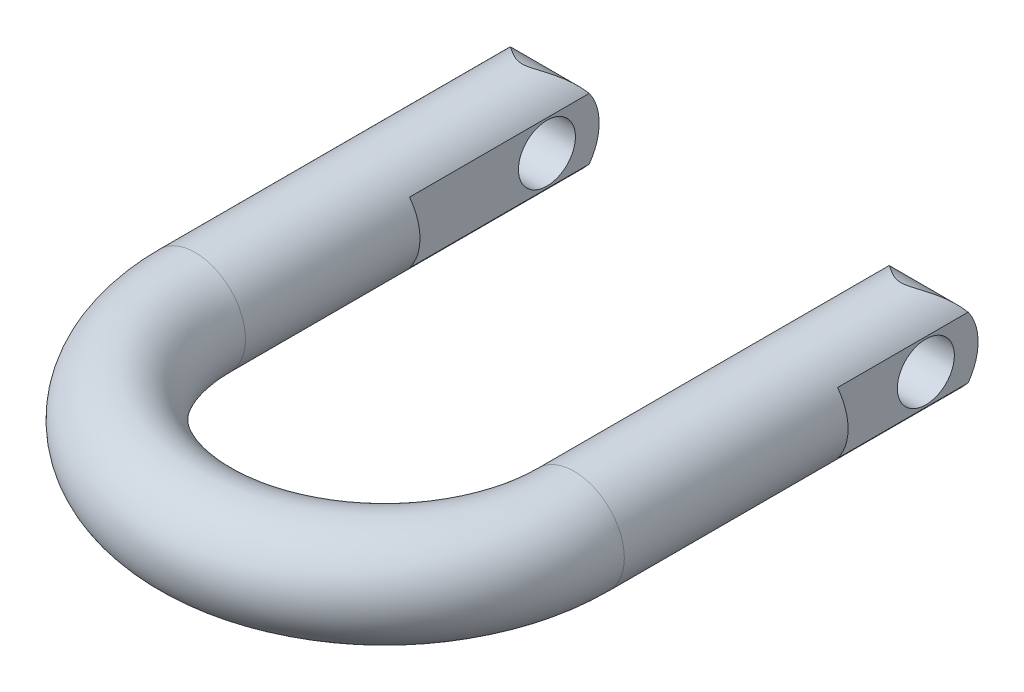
ISO-10303-21;
HEADER;
FILE_DESCRIPTION(('STEP AP214'),'2;1');
FILE_NAME('part.step','',(''),(''),'','','');
FILE_SCHEMA(('AUTOMOTIVE_DESIGN { 1 0 10303 214 1 1 1 1 }'));
ENDSEC;
DATA;
#1=APPLICATION_CONTEXT('core data for automotive mechanical design processes');
#2=APPLICATION_PROTOCOL_DEFINITION('international standard','automotive_design',2000,#1);
#3=PRODUCT_CONTEXT('',#1,'mechanical');
#4=PRODUCT('Part','Part','',(#3));
#5=PRODUCT_RELATED_PRODUCT_CATEGORY('part','',(#4));
#6=PRODUCT_DEFINITION_FORMATION('','',#4);
#7=PRODUCT_DEFINITION_CONTEXT('part definition',#1,'design');
#8=PRODUCT_DEFINITION('design','',#6,#7);
#9=PRODUCT_DEFINITION_SHAPE('','',#8);
#10=(LENGTH_UNIT() NAMED_UNIT(*) SI_UNIT(.MILLI.,.METRE.));
#11=(NAMED_UNIT(*) PLANE_ANGLE_UNIT() SI_UNIT($,.RADIAN.));
#12=(NAMED_UNIT(*) SI_UNIT($,.STERADIAN.) SOLID_ANGLE_UNIT());
#13=UNCERTAINTY_MEASURE_WITH_UNIT(LENGTH_MEASURE(1.E-05),#10,'distance_accuracy_value','');
#14=(GEOMETRIC_REPRESENTATION_CONTEXT(3) GLOBAL_UNCERTAINTY_ASSIGNED_CONTEXT((#13)) GLOBAL_UNIT_ASSIGNED_CONTEXT((#10,
#11,#12)) REPRESENTATION_CONTEXT('',''));
#15=CARTESIAN_POINT('',(0.,0.,0.));
#16=DIRECTION('',(0.,0.,1.));
#17=DIRECTION('',(1.,0.,0.));
#18=AXIS2_PLACEMENT_3D('',#15,#16,#17);
#19=CARTESIAN_POINT('',(-59.2,-30.,22.8));
#20=DIRECTION('',(1.,0.,0.));
#21=DIRECTION('',(0.,1.,0.));
#22=AXIS2_PLACEMENT_3D('',#19,#20,#21);
#23=PLANE('',#22);
#24=DIRECTION('',(0.,0.,-1.));
#25=VECTOR('',#24,1.);
#26=CARTESIAN_POINT('',(-59.2,7.91454357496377,80.6));
#27=LINE('',#26,#25);
#28=CARTESIAN_POINT('',(-59.2,7.91454357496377,-10.9366356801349));
#29=VERTEX_POINT('',#28);
#30=CARTESIAN_POINT('',(-59.2,7.91454357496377,22.8));
#31=VERTEX_POINT('',#30);
#32=EDGE_CURVE('E96',#29,#31,#27,.F.);
#33=ORIENTED_EDGE('',*,*,#32,.F.);
#34=CARTESIAN_POINT('',(-59.2,0.,0.));
#35=DIRECTION('',(1.,0.,0.));
#36=DIRECTION('',(0.,1.,0.));
#37=AXIS2_PLACEMENT_3D('',#34,#35,#36);
#38=CIRCLE('',#37,13.5);
#39=CARTESIAN_POINT('',(-59.2,-7.91454357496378,-10.9366356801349));
#40=VERTEX_POINT('',#39);
#41=EDGE_CURVE('E100',#40,#29,#38,.T.);
#42=ORIENTED_EDGE('',*,*,#41,.F.);
#43=DIRECTION('',(0.,0.,-1.));
#44=VECTOR('',#43,1.);
#45=CARTESIAN_POINT('',(-59.2,-7.91454357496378,80.6));
#46=LINE('',#45,#44);
#47=CARTESIAN_POINT('',(-59.2,-7.91454357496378,22.8));
#48=VERTEX_POINT('',#47);
#49=EDGE_CURVE('E85',#48,#40,#46,.T.);
#50=ORIENTED_EDGE('',*,*,#49,.F.);
#51=DIRECTION('',(0.,1.,0.));
#52=VECTOR('',#51,1.);
#53=CARTESIAN_POINT('',(-59.2,-30.,22.8));
#54=LINE('',#53,#52);
#55=EDGE_CURVE('E122',#48,#31,#54,.T.);
#56=ORIENTED_EDGE('',*,*,#55,.T.);
#57=EDGE_LOOP('',(#33,#42,#50,#56));
#58=FACE_BOUND('',#57,.T.);
#59=CARTESIAN_POINT('',(-59.2,0.,0.));
#60=DIRECTION('',(1.,0.,0.));
#61=DIRECTION('',(0.,0.,-1.));
#62=AXIS2_PLACEMENT_3D('',#59,#60,#61);
#63=CIRCLE('',#62,7.365);
#64=CARTESIAN_POINT('',(-59.2,0.,-7.36499999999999));
#65=VERTEX_POINT('',#64);
#66=EDGE_CURVE('E104',#65,#65,#63,.T.);
#67=ORIENTED_EDGE('',*,*,#66,.T.);
#68=EDGE_LOOP('',(#67));
#69=FACE_BOUND('',#68,.T.);
#70=ADVANCED_FACE('F14',(#58,#69),#23,.F.);
#71=CARTESIAN_POINT('',(-38.7,20.,35.5));
#72=DIRECTION('',(1.,0.,0.));
#73=DIRECTION('',(0.,1.,0.));
#74=AXIS2_PLACEMENT_3D('',#71,#72,#73);
#75=PLANE('',#74);
#76=CARTESIAN_POINT('',(-38.7,0.,0.));
#77=DIRECTION('',(1.,0.,0.));
#78=DIRECTION('',(0.,1.,0.));
#79=AXIS2_PLACEMENT_3D('',#76,#77,#78);
#80=CIRCLE('',#79,13.5);
#81=CARTESIAN_POINT('',(-38.7,7.91454357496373,-10.9366356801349));
#82=VERTEX_POINT('',#81);
#83=CARTESIAN_POINT('',(-38.7,-7.91454357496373,-10.9366356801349));
#84=VERTEX_POINT('',#83);
#85=EDGE_CURVE('E35',#82,#84,#80,.F.);
#86=ORIENTED_EDGE('',*,*,#85,.F.);
#87=DIRECTION('',(0.,0.,-1.));
#88=VECTOR('',#87,1.);
#89=CARTESIAN_POINT('',(-38.7,7.91454357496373,80.6));
#90=LINE('',#89,#88);
#91=CARTESIAN_POINT('',(-38.7,7.91454357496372,35.5));
#92=VERTEX_POINT('',#91);
#93=EDGE_CURVE('E118',#82,#92,#90,.F.);
#94=ORIENTED_EDGE('',*,*,#93,.T.);
#95=DIRECTION('',(0.,1.,0.));
#96=VECTOR('',#95,1.);
#97=CARTESIAN_POINT('',(-38.7,-20.,35.5));
#98=LINE('',#97,#96);
#99=CARTESIAN_POINT('',(-38.7,-7.91454357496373,35.5));
#100=VERTEX_POINT('',#99);
#101=EDGE_CURVE('E115',#100,#92,#98,.T.);
#102=ORIENTED_EDGE('',*,*,#101,.F.);
#103=DIRECTION('',(0.,0.,-1.));
#104=VECTOR('',#103,1.);
#105=CARTESIAN_POINT('',(-38.7,-7.91454357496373,80.6));
#106=LINE('',#105,#104);
#107=EDGE_CURVE('E120',#100,#84,#106,.T.);
#108=ORIENTED_EDGE('',*,*,#107,.T.);
#109=EDGE_LOOP('',(#86,#94,#102,#108));
#110=FACE_BOUND('',#109,.T.);
#111=CARTESIAN_POINT('',(-38.7,0.,0.));
#112=DIRECTION('',(1.,0.,0.));
#113=DIRECTION('',(0.,1.,0.));
#114=AXIS2_PLACEMENT_3D('',#111,#112,#113);
#115=CIRCLE('',#114,7.365);
#116=CARTESIAN_POINT('',(-38.7,7.36499999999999,0.));
#117=VERTEX_POINT('',#116);
#118=EDGE_CURVE('E106',#117,#117,#115,.T.);
#119=ORIENTED_EDGE('',*,*,#118,.F.);
#120=EDGE_LOOP('',(#119));
#121=FACE_BOUND('',#120,.T.);
#122=ADVANCED_FACE('F164',(#110,#121),#75,.T.);
#123=CARTESIAN_POINT('',(-48.95,0.,80.6));
#124=DIRECTION('',(0.,0.,-1.));
#125=DIRECTION('',(1.,0.,0.));
#126=AXIS2_PLACEMENT_3D('',#123,#124,#125);
#127=CYLINDRICAL_SURFACE('',#126,12.95);
#128=CARTESIAN_POINT('',(-48.95,0.,80.6));
#129=DIRECTION('',(0.,0.,1.));
#130=DIRECTION('',(0.,-1.,0.));
#131=AXIS2_PLACEMENT_3D('',#128,#129,#130);
#132=CIRCLE('',#131,12.95);
#133=CARTESIAN_POINT('',(-61.9,0.,80.6));
#134=VERTEX_POINT('',#133);
#135=EDGE_CURVE('E298',#134,#134,#132,.T.);
#136=ORIENTED_EDGE('',*,*,#135,.F.);
#137=EDGE_LOOP('',(#136));
#138=FACE_BOUND('',#137,.T.);
#139=CARTESIAN_POINT('',(-36.,0.,-13.5));
#140=CARTESIAN_POINT('',(-36.0000025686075,0.293199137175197,-13.4999974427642));
#141=CARTESIAN_POINT('',(-36.0099780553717,0.586445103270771,-13.4904275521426));
#142=CARTESIAN_POINT('',(-36.0496814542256,1.17048500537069,-13.4523487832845));
#143=CARTESIAN_POINT('',(-36.0794202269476,1.46127750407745,-13.4238294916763));
#144=CARTESIAN_POINT('',(-36.1581150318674,2.03842301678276,-13.3483967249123));
#145=CARTESIAN_POINT('',(-36.2071094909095,2.32476595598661,-13.3014464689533));
#146=CARTESIAN_POINT('',(-36.3233406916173,2.89020691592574,-13.1901381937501));
#147=CARTESIAN_POINT('',(-36.3905753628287,3.16930575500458,-13.1257821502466));
#148=CARTESIAN_POINT('',(-36.5415446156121,3.71654723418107,-12.9814013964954));
#149=CARTESIAN_POINT('',(-36.6251581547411,3.98475379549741,-12.9014916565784));
#150=CARTESIAN_POINT('',(-36.8078440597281,4.5108932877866,-12.7270857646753));
#151=CARTESIAN_POINT('',(-36.9069165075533,4.76882616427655,-12.6325895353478));
#152=CARTESIAN_POINT('',(-37.2252031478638,5.52546055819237,-12.3294033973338));
#153=CARTESIAN_POINT('',(-37.4656171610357,6.00745842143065,-12.1008908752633));
#154=CARTESIAN_POINT('',(-38.1000775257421,7.10877519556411,-11.5001649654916));
#155=CARTESIAN_POINT('',(-38.516769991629,7.70379205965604,-11.1073764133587));
#156=CARTESIAN_POINT('',(-39.1922448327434,8.5214166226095,-10.4763971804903));
#157=CARTESIAN_POINT('',(-39.4262930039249,8.78189008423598,-10.2586593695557));
#158=CARTESIAN_POINT('',(-39.9092753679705,9.27833910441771,-9.81191913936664));
#159=CARTESIAN_POINT('',(-40.1582085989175,9.51431624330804,-9.58291744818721));
#160=CARTESIAN_POINT('',(-40.7538609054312,10.0364632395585,-9.03907336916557));
#161=CARTESIAN_POINT('',(-41.105661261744,10.3133732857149,-8.72091959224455));
#162=CARTESIAN_POINT('',(-41.8303256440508,10.8263597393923,-8.07526114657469));
#163=CARTESIAN_POINT('',(-42.2032039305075,11.0624080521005,-7.74775022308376));
#164=CARTESIAN_POINT('',(-42.7775234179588,11.3864466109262,-7.25516783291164));
#165=CARTESIAN_POINT('',(-42.9713325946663,11.4893965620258,-7.09086172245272));
#166=CARTESIAN_POINT('',(-43.3643066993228,11.6854941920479,-6.7628178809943));
#167=CARTESIAN_POINT('',(-43.5634710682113,11.7786428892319,-6.59908009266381));
#168=CARTESIAN_POINT('',(-43.9674407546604,11.9551307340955,-6.2736814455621));
#169=CARTESIAN_POINT('',(-44.1722411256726,12.0384781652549,-6.11201893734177));
#170=CARTESIAN_POINT('',(-44.5884037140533,12.1954275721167,-5.79251015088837));
#171=CARTESIAN_POINT('',(-44.7997643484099,12.2690318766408,-5.63466296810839));
#172=CARTESIAN_POINT('',(-45.1612774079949,12.3843293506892,-5.37509175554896));
#173=CARTESIAN_POINT('',(-45.3093165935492,12.4286853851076,-5.27160616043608));
#174=CARTESIAN_POINT('',(-45.6095950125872,12.5127340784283,-5.06887715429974));
#175=CARTESIAN_POINT('',(-45.7618344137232,12.5524265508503,-4.96963391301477));
#176=CARTESIAN_POINT('',(-46.071116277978,12.6269481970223,-4.77711361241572));
#177=CARTESIAN_POINT('',(-46.2281559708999,12.6617801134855,-4.68383320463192));
#178=CARTESIAN_POINT('',(-46.5478629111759,12.7263040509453,-4.50557279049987));
#179=CARTESIAN_POINT('',(-46.710528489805,12.7559975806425,-4.420590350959));
#180=CARTESIAN_POINT('',(-47.1060547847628,12.820161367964,-4.23163825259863));
#181=CARTESIAN_POINT('',(-47.3419187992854,12.8520987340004,-4.13287958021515));
#182=CARTESIAN_POINT('',(-47.826418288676,12.9034447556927,-3.96971126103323));
#183=CARTESIAN_POINT('',(-48.0750109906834,12.922892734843,-3.9051939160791));
#184=CARTESIAN_POINT('',(-48.5400710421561,12.9452478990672,-3.83039349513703));
#185=CARTESIAN_POINT('',(-48.7552395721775,12.9503198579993,-3.81303212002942));
#186=CARTESIAN_POINT('',(-49.1852126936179,12.9496485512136,-3.81531215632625));
#187=CARTESIAN_POINT('',(-49.400017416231,12.943910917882,-3.83493429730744));
#188=CARTESIAN_POINT('',(-49.8846621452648,12.9191220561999,-3.91771502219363));
#189=CARTESIAN_POINT('',(-50.1523973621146,12.8966924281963,-3.99184892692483));
#190=CARTESIAN_POINT('',(-50.5424414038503,12.8523939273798,-4.13138570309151));
#191=CARTESIAN_POINT('',(-50.6708828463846,12.8357887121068,-4.18281008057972));
#192=CARTESIAN_POINT('',(-50.9240373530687,12.7992959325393,-4.2931816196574));
#193=CARTESIAN_POINT('',(-51.0487507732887,12.7794086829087,-4.35212805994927));
#194=CARTESIAN_POINT('',(-51.3381987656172,12.7290068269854,-4.49780208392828));
#195=CARTESIAN_POINT('',(-51.5014666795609,12.6972227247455,-4.58697565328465));
#196=CARTESIAN_POINT('',(-51.8224827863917,12.6284711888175,-4.77300446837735));
#197=CARTESIAN_POINT('',(-51.9802283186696,12.5915012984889,-4.86986334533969));
#198=CARTESIAN_POINT('',(-52.2911937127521,12.5125816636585,-5.06920193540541));
#199=CARTESIAN_POINT('',(-52.4444059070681,12.4706240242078,-5.17169041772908));
#200=CARTESIAN_POINT('',(-52.7467295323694,12.3819280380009,-5.38059161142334));
#201=CARTESIAN_POINT('',(-52.8958402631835,12.3351888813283,-5.48700498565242));
#202=CARTESIAN_POINT('',(-53.3391653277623,12.1875023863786,-5.81130116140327));
#203=CARTESIAN_POINT('',(-53.6280022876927,12.0794381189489,-6.03333236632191));
#204=CARTESIAN_POINT('',(-54.1938035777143,11.8447707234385,-6.48194753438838));
#205=CARTESIAN_POINT('',(-54.4707777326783,11.7181833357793,-6.70852749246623));
#206=CARTESIAN_POINT('',(-55.1267255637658,11.3901318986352,-7.25634261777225));
#207=CARTESIAN_POINT('',(-55.50065853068,11.1793177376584,-7.57807881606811));
#208=CARTESIAN_POINT('',(-56.2293451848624,10.7191067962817,-8.21619240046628));
#209=CARTESIAN_POINT('',(-56.5840872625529,10.4696870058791,-8.53256646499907));
#210=CARTESIAN_POINT('',(-57.2715078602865,9.93200378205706,-9.15276686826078));
#211=CARTESIAN_POINT('',(-57.6042643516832,9.64388998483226,-9.45663592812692));
#212=CARTESIAN_POINT('',(-58.2460445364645,9.02684677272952,-10.0473018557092));
#213=CARTESIAN_POINT('',(-58.5550839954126,8.69794485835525,-10.3341100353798));
#214=CARTESIAN_POINT('',(-59.0423131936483,8.12013881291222,-10.7887696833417));
#215=CARTESIAN_POINT('',(-59.2286040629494,7.88324209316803,-10.9632761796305));
#216=CARTESIAN_POINT('',(-59.5876514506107,7.39158213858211,-11.3005901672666));
#217=CARTESIAN_POINT('',(-59.7604119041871,7.13682413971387,-11.4634010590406));
#218=CARTESIAN_POINT('',(-60.0905062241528,6.60970972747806,-11.7752048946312));
#219=CARTESIAN_POINT('',(-60.2478496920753,6.33736444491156,-11.9242064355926));
#220=CARTESIAN_POINT('',(-60.5451589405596,5.77544512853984,-12.2062689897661));
#221=CARTESIAN_POINT('',(-60.6851274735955,5.48587383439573,-12.3393325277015));
#222=CARTESIAN_POINT('',(-60.9235909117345,4.94051776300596,-12.5663552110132));
#223=CARTESIAN_POINT('',(-61.0251035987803,4.68722186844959,-12.6631289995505));
#224=CARTESIAN_POINT('',(-61.2132109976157,4.17034227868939,-12.8426263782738));
#225=CARTESIAN_POINT('',(-61.299808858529,3.90676076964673,-12.9253529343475));
#226=CARTESIAN_POINT('',(-61.4567709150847,3.3706317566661,-13.0754077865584));
#227=CARTESIAN_POINT('',(-61.5271417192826,3.09808795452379,-13.142742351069));
#228=CARTESIAN_POINT('',(-61.6505042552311,2.5455468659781,-13.2608442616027));
#229=CARTESIAN_POINT('',(-61.7034958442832,2.26554951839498,-13.3116114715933));
#230=CARTESIAN_POINT('',(-61.7913532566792,1.69850168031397,-13.3958088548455));
#231=CARTESIAN_POINT('',(-61.826116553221,1.41142060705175,-13.4291409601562));
#232=CARTESIAN_POINT('',(-61.8763635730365,0.834023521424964,-13.4773263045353));
#233=CARTESIAN_POINT('',(-61.8918472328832,0.543707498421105,-13.4921794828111));
#234=CARTESIAN_POINT('',(-61.9032077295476,-0.037616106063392,-13.503076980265));
#235=CARTESIAN_POINT('',(-61.8990876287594,-0.328623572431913,-13.499124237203));
#236=CARTESIAN_POINT('',(-61.871333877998,-0.908829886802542,-13.47250361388));
#237=CARTESIAN_POINT('',(-61.8477013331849,-1.19802883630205,-13.4498367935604));
#238=CARTESIAN_POINT('',(-61.7843973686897,-1.74641715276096,-13.3891442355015));
#239=CARTESIAN_POINT('',(-61.7463548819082,-2.00597135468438,-13.3526786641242));
#240=CARTESIAN_POINT('',(-61.6551436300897,-2.51990686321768,-13.2652932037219));
#241=CARTESIAN_POINT('',(-61.6019759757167,-2.77428854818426,-13.2143743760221));
#242=CARTESIAN_POINT('',(-61.4813275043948,-3.27643255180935,-13.0989069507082));
#243=CARTESIAN_POINT('',(-61.4138479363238,-3.52419544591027,-13.0343595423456));
#244=CARTESIAN_POINT('',(-61.2654829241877,-4.01203452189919,-12.8925615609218));
#245=CARTESIAN_POINT('',(-61.1845922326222,-4.25210765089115,-12.8153060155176));
#246=CARTESIAN_POINT('',(-61.0044197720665,-4.7397883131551,-12.6434076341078));
#247=CARTESIAN_POINT('',(-60.9042553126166,-4.98677687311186,-12.5479339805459));
#248=CARTESIAN_POINT('',(-60.6910015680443,-5.47002959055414,-12.344940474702));
#249=CARTESIAN_POINT('',(-60.5779072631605,-5.70628953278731,-12.2374159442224));
#250=CARTESIAN_POINT('',(-60.2210183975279,-6.39810055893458,-11.8986432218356));
#251=CARTESIAN_POINT('',(-59.9595599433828,-6.83683652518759,-11.6511404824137));
#252=CARTESIAN_POINT('',(-59.4593182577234,-7.57702324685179,-11.1797968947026));
#253=CARTESIAN_POINT('',(-59.2278006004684,-7.88767826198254,-10.9623601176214));
#254=CARTESIAN_POINT('',(-58.7447514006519,-8.48005390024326,-10.5108171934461));
#255=CARTESIAN_POINT('',(-58.4932170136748,-8.76177039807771,-10.2767086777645));
#256=CARTESIAN_POINT('',(-57.972292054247,-9.29735124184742,-9.79486641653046));
#257=CARTESIAN_POINT('',(-57.7028561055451,-9.55114011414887,-9.54709834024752));
#258=CARTESIAN_POINT('',(-57.1488328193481,-10.0307454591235,-9.04187036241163));
#259=CARTESIAN_POINT('',(-56.8642483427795,-10.2565671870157,-8.78441229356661));
#260=CARTESIAN_POINT('',(-56.273243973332,-10.6869026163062,-8.25586806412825));
#261=CARTESIAN_POINT('',(-55.9664399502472,-10.890665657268,-7.98460174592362));
#262=CARTESIAN_POINT('',(-55.3386025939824,-11.2704452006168,-7.43892462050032));
#263=CARTESIAN_POINT('',(-55.0175641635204,-11.446451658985,-7.16451271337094));
#264=CARTESIAN_POINT('',(-54.3612484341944,-11.7709310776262,-6.61783615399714));
#265=CARTESIAN_POINT('',(-54.0260007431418,-11.9194581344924,-6.345568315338));
#266=CARTESIAN_POINT('',(-53.5101312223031,-12.1219509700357,-5.94397771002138));
#267=CARTESIAN_POINT('',(-53.3360554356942,-12.1860515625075,-5.81128305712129));
#268=CARTESIAN_POINT('',(-52.9828756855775,-12.3074495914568,-5.54954443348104));
#269=CARTESIAN_POINT('',(-52.8037726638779,-12.364748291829,-5.4204997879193));
#270=CARTESIAN_POINT('',(-52.4800699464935,-12.4604536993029,-5.19600930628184));
#271=CARTESIAN_POINT('',(-52.33663838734,-12.5002303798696,-5.09946487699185));
#272=CARTESIAN_POINT('',(-52.0456167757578,-12.5754623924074,-4.91101123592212));
#273=CARTESIAN_POINT('',(-51.8980264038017,-12.6109173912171,-4.81910238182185));
#274=CARTESIAN_POINT('',(-51.5980819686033,-12.677292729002,-4.64168135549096));
#275=CARTESIAN_POINT('',(-51.4457295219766,-12.7082145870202,-4.55616704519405));
#276=CARTESIAN_POINT('',(-51.1355636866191,-12.7652126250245,-4.39394502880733));
#277=CARTESIAN_POINT('',(-50.9777521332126,-12.7912904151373,-4.31723439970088));
#278=CARTESIAN_POINT('',(-50.5943137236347,-12.8471543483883,-4.14863312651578));
#279=CARTESIAN_POINT('',(-50.3658510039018,-12.8745390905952,-4.06217143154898));
#280=CARTESIAN_POINT('',(-49.8977648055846,-12.9173845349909,-3.92385848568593));
#281=CARTESIAN_POINT('',(-49.6581844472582,-12.9328877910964,-3.87188380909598));
#282=CARTESIAN_POINT('',(-49.2927917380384,-12.946051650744,-3.82752192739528));
#283=CARTESIAN_POINT('',(-49.1691053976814,-12.9487402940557,-3.81839159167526));
#284=CARTESIAN_POINT('',(-48.9213874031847,-12.9505591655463,-3.81222356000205));
#285=CARTESIAN_POINT('',(-48.7973557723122,-12.9496896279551,-3.81518506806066));
#286=CARTESIAN_POINT('',(-48.5501210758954,-12.944416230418,-3.83303575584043));
#287=CARTESIAN_POINT('',(-48.4269189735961,-12.9400088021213,-3.84793697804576));
#288=CARTESIAN_POINT('',(-48.1824751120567,-12.9278155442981,-3.88870723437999));
#289=CARTESIAN_POINT('',(-48.0612348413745,-12.9200272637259,-3.9145842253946));
#290=CARTESIAN_POINT('',(-47.6328963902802,-12.8865565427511,-4.02409487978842));
#291=CARTESIAN_POINT('',(-47.3332480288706,-12.8519911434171,-4.13457384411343));
#292=CARTESIAN_POINT('',(-46.8989494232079,-12.7873931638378,-4.32866446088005));
#293=CARTESIAN_POINT('',(-46.7563274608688,-12.7636494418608,-4.39832956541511));
#294=CARTESIAN_POINT('',(-46.4755377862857,-12.7121924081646,-4.54490710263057));
#295=CARTESIAN_POINT('',(-46.3373694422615,-12.6844796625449,-4.62181850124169));
#296=CARTESIAN_POINT('',(-46.0054060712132,-12.6123783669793,-4.81588992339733));
#297=CARTESIAN_POINT('',(-45.8137474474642,-12.5660016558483,-4.93592629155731));
#298=CARTESIAN_POINT('',(-45.4371619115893,-12.4659697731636,-5.1833823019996));
#299=CARTESIAN_POINT('',(-45.252237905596,-12.4123115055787,-5.31080507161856));
#300=CARTESIAN_POINT('',(-44.8878171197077,-12.2978737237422,-5.57068131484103));
#301=CARTESIAN_POINT('',(-44.708328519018,-12.2370840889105,-5.70314175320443));
#302=CARTESIAN_POINT('',(-44.3542377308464,-12.1085472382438,-5.97119914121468));
#303=CARTESIAN_POINT('',(-44.1796362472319,-12.040799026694,-6.10679653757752));
#304=CARTESIAN_POINT('',(-43.6614878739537,-11.8268432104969,-6.51696605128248));
#305=CARTESIAN_POINT('',(-43.3244010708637,-11.6701790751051,-6.79432559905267));
#306=CARTESIAN_POINT('',(-42.6654819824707,-11.3289320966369,-7.34925545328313));
#307=CARTESIAN_POINT('',(-42.3436376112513,-11.1443718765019,-7.62682540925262));
#308=CARTESIAN_POINT('',(-41.6986099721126,-10.7365112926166,-8.19174734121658));
#309=CARTESIAN_POINT('',(-41.3761745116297,-10.5117286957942,-8.47888857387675));
#310=CARTESIAN_POINT('',(-40.7481322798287,-10.0293886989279,-9.04431022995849));
#311=CARTESIAN_POINT('',(-40.4425314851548,-9.77181976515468,-9.32258749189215));
#312=CARTESIAN_POINT('',(-39.8512738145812,-9.22375628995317,-9.86511928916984));
#313=CARTESIAN_POINT('',(-39.5655594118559,-8.93336369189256,-10.1294136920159));
#314=CARTESIAN_POINT('',(-39.0162560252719,-8.31823754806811,-10.640330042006));
#315=CARTESIAN_POINT('',(-38.7526553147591,-7.99352241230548,-10.8869613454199));
#316=CARTESIAN_POINT('',(-38.3315774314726,-7.41855483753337,-11.28250852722));
#317=CARTESIAN_POINT('',(-38.1670704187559,-7.17759063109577,-11.4374988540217));
#318=CARTESIAN_POINT('',(-37.8517562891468,-6.67969104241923,-11.7352382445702));
#319=CARTESIAN_POINT('',(-37.7009457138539,-6.42275971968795,-11.8779903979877));
#320=CARTESIAN_POINT('',(-37.4147750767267,-5.89335252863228,-12.1493560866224));
#321=CARTESIAN_POINT('',(-37.2794112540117,-5.62088046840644,-12.2779730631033));
#322=CARTESIAN_POINT('',(-37.0260022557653,-5.06113658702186,-12.5190935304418));
#323=CARTESIAN_POINT('',(-36.9079541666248,-4.77386726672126,-12.6315997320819));
#324=CARTESIAN_POINT('',(-36.7073120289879,-4.22968102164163,-12.8230319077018));
#325=CARTESIAN_POINT('',(-36.6220560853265,-3.97462530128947,-12.9044635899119));
#326=CARTESIAN_POINT('',(-36.4667039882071,-3.45587759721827,-13.0529559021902));
#327=CARTESIAN_POINT('',(-36.3966048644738,-3.19218731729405,-13.1200193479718));
#328=CARTESIAN_POINT('',(-36.2727825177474,-2.65812782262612,-13.2385430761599));
#329=CARTESIAN_POINT('',(-36.2190263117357,-2.3877732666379,-13.2900347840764));
#330=CARTESIAN_POINT('',(-36.1286483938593,-1.84172695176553,-13.3766359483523));
#331=CARTESIAN_POINT('',(-36.0920184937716,-1.56603780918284,-13.4117532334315));
#332=CARTESIAN_POINT('',(-36.0429341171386,-1.075258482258,-13.4588192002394));
#333=CARTESIAN_POINT('',(-36.0268528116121,-0.860852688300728,-13.4742429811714));
#334=CARTESIAN_POINT('',(-36.0053837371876,-0.430973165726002,-13.4948353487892));
#335=CARTESIAN_POINT('',(-35.9999981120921,-0.215499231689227,-13.5000018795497));
#336=CARTESIAN_POINT('',(-36.,0.,-13.5));
#337=B_SPLINE_CURVE_WITH_KNOTS('',3,(#139,#140,#141,#142,#143,#144,#145,#146,#147,#148,#149,
#150,#151,#152,#153,#154,#155,#156,#157,#158,#159,#160,#161,#162,#163,#164,#165,#166,#167,#168,
#169,#170,#171,#172,#173,#174,#175,#176,#177,#178,#179,#180,#181,#182,#183,#184,#185,#186,#187,
#188,#189,#190,#191,#192,#193,#194,#195,#196,#197,#198,#199,#200,#201,#202,#203,#204,#205,#206,
#207,#208,#209,#210,#211,#212,#213,#214,#215,#216,#217,#218,#219,#220,#221,#222,#223,#224,#225,
#226,#227,#228,#229,#230,#231,#232,#233,#234,#235,#236,#237,#238,#239,#240,#241,#242,#243,#244,
#245,#246,#247,#248,#249,#250,#251,#252,#253,#254,#255,#256,#257,#258,#259,#260,#261,#262,#263,
#264,#265,#266,#267,#268,#269,#270,#271,#272,#273,#274,#275,#276,#277,#278,#279,#280,#281,#282,
#283,#284,#285,#286,#287,#288,#289,#290,#291,#292,#293,#294,#295,#296,#297,#298,#299,#300,#301,
#302,#303,#304,#305,#306,#307,#308,#309,#310,#311,#312,#313,#314,#315,#316,#317,#318,#319,#320,
#321,#322,#323,#324,#325,#326,#327,#328,#329,#330,#331,#332,#333,#334,#335,#336),.UNSPECIFIED.,
.T.,.F.,(4,2,2,2,2,2,2,2,2,2,2,2,2,2,2,2,2,2,2,2,2,2,2,2,2,2,2,2,2,2,2,2,2,2,2,2,2,2,2,2,2,2,2,
2,2,2,2,2,2,2,2,2,2,2,2,2,2,2,2,2,2,2,2,2,2,2,2,2,2,2,2,2,2,2,2,2,2,2,2,2,2,2,2,2,2,2,2,2,2,2,2,
2,2,2,2,2,2,2,4),(0.,0.879356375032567,1.75919638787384,2.64080120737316,3.5223059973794,
4.3975266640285,5.27275197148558,7.02173493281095,9.48494296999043,10.7211666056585,
11.9573104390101,13.6028475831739,15.2495116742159,16.0717741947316,16.893951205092,
17.7154282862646,18.5367086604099,19.0945537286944,19.652421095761,20.2099723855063,
20.7673596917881,21.5384329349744,22.3070663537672,22.9515143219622,23.5956265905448,
24.4265309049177,24.8443980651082,25.2622251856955,25.8280112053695,26.3940661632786,
26.9610293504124,27.5280887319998,28.6672386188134,29.805426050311,31.4129954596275,
33.0215267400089,34.6240076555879,36.2254139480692,37.2693663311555,38.3130139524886,
39.3560074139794,40.3988354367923,41.2665972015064,42.1341755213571,43.0013998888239,
43.868631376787,44.7406897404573,45.6127509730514,46.484675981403,47.3565516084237,
48.150215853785,48.9438218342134,49.7373585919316,50.531206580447,51.3797014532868,
52.2285268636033,53.9256622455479,55.2568785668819,56.588284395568,57.9232042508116,
59.2578728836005,60.6290037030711,62.0006295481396,63.3695257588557,64.0536174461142,
64.7375818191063,65.2696914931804,65.8018421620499,66.3338140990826,66.8656088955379,
67.6009625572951,68.3336700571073,68.7052492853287,69.0768040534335,69.4487340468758,
69.8209341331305,70.7782545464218,71.2596678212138,71.7410125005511,72.4331428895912,
73.1255684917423,73.8189889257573,74.5125087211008,75.9026283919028,77.29162670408,
78.7505300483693,80.2099480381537,81.6649518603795,83.1191791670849,84.1095244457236,
85.0996189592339,86.0894718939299,87.0791580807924,87.9212728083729,88.7632223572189,
89.6034612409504,90.4432979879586,91.0894890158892,91.735809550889),.UNSPECIFIED.);
#338=EDGE_CURVE('E9',#82,#29,#337,.T.);
#339=ORIENTED_EDGE('',*,*,#338,.T.);
#340=ORIENTED_EDGE('',*,*,#32,.T.);
#341=CARTESIAN_POINT('',(-48.95,0.,22.8));
#342=DIRECTION('',(0.,0.,1.));
#343=DIRECTION('',(0.,-1.,0.));
#344=AXIS2_PLACEMENT_3D('',#341,#342,#343);
#345=CIRCLE('',#344,12.95);
#346=EDGE_CURVE('E90',#31,#48,#345,.T.);
#347=ORIENTED_EDGE('',*,*,#346,.T.);
#348=ORIENTED_EDGE('',*,*,#49,.T.);
#349=EDGE_CURVE('E19',#40,#84,#337,.T.);
#350=ORIENTED_EDGE('',*,*,#349,.T.);
#351=ORIENTED_EDGE('',*,*,#107,.F.);
#352=CARTESIAN_POINT('',(-48.95,0.,35.5));
#353=DIRECTION('',(0.,0.,-1.));
#354=DIRECTION('',(0.,1.,0.));
#355=AXIS2_PLACEMENT_3D('',#352,#353,#354);
#356=CIRCLE('',#355,12.95);
#357=EDGE_CURVE('E102',#92,#100,#356,.T.);
#358=ORIENTED_EDGE('',*,*,#357,.F.);
#359=ORIENTED_EDGE('',*,*,#93,.F.);
#360=EDGE_LOOP('',(#339,#340,#347,#348,#350,#351,#358,#359));
#361=FACE_BOUND('',#360,.T.);
#362=ADVANCED_FACE('F86',(#138,#361),#127,.T.);
#363=CARTESIAN_POINT('',(48.95,0.,80.6));
#364=DIRECTION('',(0.,0.,-1.));
#365=DIRECTION('',(1.,0.,0.));
#366=AXIS2_PLACEMENT_3D('',#363,#364,#365);
#367=CYLINDRICAL_SURFACE('',#366,12.95);
#368=CARTESIAN_POINT('',(48.95,0.,80.6));
#369=DIRECTION('',(0.,0.,-1.));
#370=DIRECTION('',(0.,-1.,0.));
#371=AXIS2_PLACEMENT_3D('',#368,#369,#370);
#372=CIRCLE('',#371,12.95);
#373=CARTESIAN_POINT('',(61.9,0.,80.6));
#374=VERTEX_POINT('',#373);
#375=EDGE_CURVE('E282',#374,#374,#372,.T.);
#376=ORIENTED_EDGE('',*,*,#375,.T.);
#377=EDGE_LOOP('',(#376));
#378=FACE_BOUND('',#377,.T.);
#379=DIRECTION('',(0.,0.,-1.));
#380=VECTOR('',#379,1.);
#381=CARTESIAN_POINT('',(59.2,7.91454357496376,80.6));
#382=LINE('',#381,#380);
#383=CARTESIAN_POINT('',(59.2,7.91454357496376,22.8));
#384=VERTEX_POINT('',#383);
#385=CARTESIAN_POINT('',(59.2,7.91454357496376,-10.9366356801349));
#386=VERTEX_POINT('',#385);
#387=EDGE_CURVE('E284',#384,#386,#382,.T.);
#388=ORIENTED_EDGE('',*,*,#387,.T.);
#389=CARTESIAN_POINT('',(61.9,0.,-13.5));
#390=CARTESIAN_POINT('',(61.8999974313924,0.293199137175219,-13.4999974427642));
#391=CARTESIAN_POINT('',(61.8900219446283,0.586445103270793,-13.4904275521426));
#392=CARTESIAN_POINT('',(61.8503185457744,1.17048500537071,-13.4523487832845));
#393=CARTESIAN_POINT('',(61.8205797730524,1.46127750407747,-13.4238294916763));
#394=CARTESIAN_POINT('',(61.7418849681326,2.03842301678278,-13.3483967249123));
#395=CARTESIAN_POINT('',(61.6928905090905,2.32476595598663,-13.3014464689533));
#396=CARTESIAN_POINT('',(61.5766593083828,2.89020691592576,-13.1901381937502));
#397=CARTESIAN_POINT('',(61.5094246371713,3.16930575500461,-13.1257821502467));
#398=CARTESIAN_POINT('',(61.3584553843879,3.71654723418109,-12.9814013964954));
#399=CARTESIAN_POINT('',(61.2748418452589,3.98475379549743,-12.9014916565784));
#400=CARTESIAN_POINT('',(61.0921559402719,4.51089328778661,-12.7270857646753));
#401=CARTESIAN_POINT('',(60.9930834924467,4.76882616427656,-12.6325895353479));
#402=CARTESIAN_POINT('',(60.6747968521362,5.52546055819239,-12.3294033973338));
#403=CARTESIAN_POINT('',(60.4343828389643,6.00745842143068,-12.1008908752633));
#404=CARTESIAN_POINT('',(59.7999224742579,7.10877519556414,-11.5001649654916));
#405=CARTESIAN_POINT('',(59.383230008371,7.70379205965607,-11.1073764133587));
#406=CARTESIAN_POINT('',(58.7077551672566,8.52141662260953,-10.4763971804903));
#407=CARTESIAN_POINT('',(58.4737069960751,8.781890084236,-10.2586593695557));
#408=CARTESIAN_POINT('',(57.9907246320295,9.27833910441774,-9.81191913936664));
#409=CARTESIAN_POINT('',(57.7417914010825,9.51431624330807,-9.58291744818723));
#410=CARTESIAN_POINT('',(57.1461390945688,10.0364632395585,-9.03907336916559));
#411=CARTESIAN_POINT('',(56.794338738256,10.3133732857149,-8.72091959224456));
#412=CARTESIAN_POINT('',(56.0696743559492,10.8263597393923,-8.07526114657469));
#413=CARTESIAN_POINT('',(55.6967960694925,11.0624080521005,-7.74775022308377));
#414=CARTESIAN_POINT('',(55.1224765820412,11.3864466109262,-7.25516783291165));
#415=CARTESIAN_POINT('',(54.9286674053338,11.4893965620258,-7.09086172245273));
#416=CARTESIAN_POINT('',(54.5356933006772,11.6854941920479,-6.76281788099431));
#417=CARTESIAN_POINT('',(54.3365289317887,11.7786428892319,-6.59908009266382));
#418=CARTESIAN_POINT('',(53.9325592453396,11.9551307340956,-6.27368144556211));
#419=CARTESIAN_POINT('',(53.7277588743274,12.0384781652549,-6.11201893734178));
#420=CARTESIAN_POINT('',(53.3115962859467,12.1954275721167,-5.79251015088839));
#421=CARTESIAN_POINT('',(53.1002356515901,12.2690318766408,-5.63466296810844));
#422=CARTESIAN_POINT('',(52.7387225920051,12.3843293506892,-5.375091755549));
#423=CARTESIAN_POINT('',(52.5906834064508,12.4286853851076,-5.2716061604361));
#424=CARTESIAN_POINT('',(52.2904049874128,12.5127340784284,-5.06887715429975));
#425=CARTESIAN_POINT('',(52.1381655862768,12.5524265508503,-4.96963391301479));
#426=CARTESIAN_POINT('',(51.828883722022,12.6269481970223,-4.77711361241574));
#427=CARTESIAN_POINT('',(51.6718440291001,12.6617801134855,-4.68383320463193));
#428=CARTESIAN_POINT('',(51.3521370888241,12.7263040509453,-4.50557279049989));
#429=CARTESIAN_POINT('',(51.1894715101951,12.7559975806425,-4.42059035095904));
#430=CARTESIAN_POINT('',(50.7939452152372,12.820161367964,-4.23163825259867));
#431=CARTESIAN_POINT('',(50.5580812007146,12.8520987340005,-4.13287958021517));
#432=CARTESIAN_POINT('',(50.073581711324,12.9034447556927,-3.96971126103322));
#433=CARTESIAN_POINT('',(49.8249890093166,12.922892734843,-3.9051939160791));
#434=CARTESIAN_POINT('',(49.3599289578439,12.9452478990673,-3.83039349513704));
#435=CARTESIAN_POINT('',(49.1447604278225,12.9503198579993,-3.81303212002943));
#436=CARTESIAN_POINT('',(48.714787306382,12.9496485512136,-3.81531215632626));
#437=CARTESIAN_POINT('',(48.4999825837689,12.943910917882,-3.83493429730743));
#438=CARTESIAN_POINT('',(48.0153378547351,12.9191220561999,-3.91771502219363));
#439=CARTESIAN_POINT('',(47.7476026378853,12.8966924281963,-3.99184892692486));
#440=CARTESIAN_POINT('',(47.3575585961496,12.8523939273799,-4.13138570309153));
#441=CARTESIAN_POINT('',(47.2291171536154,12.8357887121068,-4.18281008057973));
#442=CARTESIAN_POINT('',(46.9759626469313,12.7992959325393,-4.29318161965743));
#443=CARTESIAN_POINT('',(46.8512492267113,12.7794086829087,-4.35212805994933));
#444=CARTESIAN_POINT('',(46.5618012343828,12.7290068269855,-4.49780208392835));
#445=CARTESIAN_POINT('',(46.3985333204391,12.6972227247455,-4.58697565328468));
#446=CARTESIAN_POINT('',(46.0775172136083,12.6284711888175,-4.77300446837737));
#447=CARTESIAN_POINT('',(45.9197716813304,12.5915012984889,-4.86986334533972));
#448=CARTESIAN_POINT('',(45.6088062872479,12.5125816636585,-5.06920193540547));
#449=CARTESIAN_POINT('',(45.4555940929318,12.4706240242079,-5.17169041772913));
#450=CARTESIAN_POINT('',(45.1532704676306,12.3819280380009,-5.38059161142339));
#451=CARTESIAN_POINT('',(45.0041597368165,12.3351888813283,-5.48700498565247));
#452=CARTESIAN_POINT('',(44.5608346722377,12.1875023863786,-5.81130116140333));
#453=CARTESIAN_POINT('',(44.2719977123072,12.0794381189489,-6.03333236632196));
#454=CARTESIAN_POINT('',(43.7061964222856,11.8447707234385,-6.48194753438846));
#455=CARTESIAN_POINT('',(43.4292222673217,11.7181833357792,-6.70852749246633));
#456=CARTESIAN_POINT('',(42.7732744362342,11.3901318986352,-7.25634261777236));
#457=CARTESIAN_POINT('',(42.3993414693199,11.1793177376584,-7.57807881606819));
#458=CARTESIAN_POINT('',(41.6706548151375,10.7191067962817,-8.21619240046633));
#459=CARTESIAN_POINT('',(41.315912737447,10.4696870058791,-8.53256646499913));
#460=CARTESIAN_POINT('',(40.6284921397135,9.93200378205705,-9.15276686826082));
#461=CARTESIAN_POINT('',(40.2957356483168,9.64388998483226,-9.45663592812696));
#462=CARTESIAN_POINT('',(39.6539554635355,9.0268467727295,-10.0473018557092));
#463=CARTESIAN_POINT('',(39.3449160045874,8.69794485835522,-10.3341100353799));
#464=CARTESIAN_POINT('',(38.8576868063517,8.12013881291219,-10.7887696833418));
#465=CARTESIAN_POINT('',(38.6713959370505,7.88324209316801,-10.9632761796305));
#466=CARTESIAN_POINT('',(38.3123485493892,7.3915821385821,-11.3005901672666));
#467=CARTESIAN_POINT('',(38.1395880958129,7.13682413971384,-11.4634010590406));
#468=CARTESIAN_POINT('',(37.8094937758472,6.60970972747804,-11.7752048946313));
#469=CARTESIAN_POINT('',(37.6521503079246,6.33736444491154,-11.9242064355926));
#470=CARTESIAN_POINT('',(37.3548410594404,5.77544512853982,-12.2062689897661));
#471=CARTESIAN_POINT('',(37.2148725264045,5.4858738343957,-12.3393325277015));
#472=CARTESIAN_POINT('',(36.9764090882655,4.94051776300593,-12.5663552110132));
#473=CARTESIAN_POINT('',(36.8748964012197,4.68722186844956,-12.6631289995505));
#474=CARTESIAN_POINT('',(36.6867890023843,4.17034227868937,-12.8426263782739));
#475=CARTESIAN_POINT('',(36.600191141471,3.90676076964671,-12.9253529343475));
#476=CARTESIAN_POINT('',(36.4432290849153,3.37063175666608,-13.0754077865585));
#477=CARTESIAN_POINT('',(36.3728582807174,3.09808795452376,-13.142742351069));
#478=CARTESIAN_POINT('',(36.2494957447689,2.54554686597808,-13.2608442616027));
#479=CARTESIAN_POINT('',(36.1965041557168,2.26554951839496,-13.3116114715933));
#480=CARTESIAN_POINT('',(36.1086467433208,1.69850168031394,-13.3958088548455));
#481=CARTESIAN_POINT('',(36.073883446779,1.41142060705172,-13.4291409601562));
#482=CARTESIAN_POINT('',(36.0236364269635,0.834023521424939,-13.4773263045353));
#483=CARTESIAN_POINT('',(36.0081527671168,0.54370749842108,-13.4921794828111));
#484=CARTESIAN_POINT('',(35.9967922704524,-0.0376161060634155,-13.503076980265));
#485=CARTESIAN_POINT('',(36.0009123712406,-0.328623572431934,-13.499124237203));
#486=CARTESIAN_POINT('',(36.028666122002,-0.908829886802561,-13.47250361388));
#487=CARTESIAN_POINT('',(36.0522986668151,-1.19802883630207,-13.4498367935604));
#488=CARTESIAN_POINT('',(36.1156026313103,-1.74641715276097,-13.3891442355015));
#489=CARTESIAN_POINT('',(36.1536451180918,-2.00597135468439,-13.3526786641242));
#490=CARTESIAN_POINT('',(36.2448563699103,-2.51990686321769,-13.2652932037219));
#491=CARTESIAN_POINT('',(36.2980240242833,-2.77428854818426,-13.214374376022));
#492=CARTESIAN_POINT('',(36.4186724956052,-3.27643255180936,-13.0989069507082));
#493=CARTESIAN_POINT('',(36.4861520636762,-3.52419544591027,-13.0343595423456));
#494=CARTESIAN_POINT('',(36.6345170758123,-4.0120345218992,-12.8925615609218));
#495=CARTESIAN_POINT('',(36.7154077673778,-4.25210765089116,-12.8153060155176));
#496=CARTESIAN_POINT('',(36.8955802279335,-4.73978831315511,-12.6434076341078));
#497=CARTESIAN_POINT('',(36.9957446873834,-4.98677687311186,-12.5479339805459));
#498=CARTESIAN_POINT('',(37.2089984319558,-5.47002959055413,-12.344940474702));
#499=CARTESIAN_POINT('',(37.3220927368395,-5.7062895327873,-12.2374159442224));
#500=CARTESIAN_POINT('',(37.6789816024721,-6.39810055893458,-11.8986432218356));
#501=CARTESIAN_POINT('',(37.9404400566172,-6.8368365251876,-11.6511404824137));
#502=CARTESIAN_POINT('',(38.4406817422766,-7.5770232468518,-11.1797968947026));
#503=CARTESIAN_POINT('',(38.6721993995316,-7.88767826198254,-10.9623601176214));
#504=CARTESIAN_POINT('',(39.1552485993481,-8.48005390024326,-10.5108171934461));
#505=CARTESIAN_POINT('',(39.4067829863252,-8.76177039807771,-10.2767086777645));
#506=CARTESIAN_POINT('',(39.927707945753,-9.29735124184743,-9.79486641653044));
#507=CARTESIAN_POINT('',(40.1971438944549,-9.55114011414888,-9.5470983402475));
#508=CARTESIAN_POINT('',(40.7511671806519,-10.0307454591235,-9.04187036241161));
#509=CARTESIAN_POINT('',(41.0357516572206,-10.2565671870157,-8.78441229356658));
#510=CARTESIAN_POINT('',(41.6267560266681,-10.6869026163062,-8.25586806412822));
#511=CARTESIAN_POINT('',(41.9335600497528,-10.890665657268,-7.98460174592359));
#512=CARTESIAN_POINT('',(42.5613974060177,-11.2704452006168,-7.43892462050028));
#513=CARTESIAN_POINT('',(42.8824358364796,-11.446451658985,-7.1645127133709));
#514=CARTESIAN_POINT('',(43.5387515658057,-11.7709310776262,-6.61783615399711));
#515=CARTESIAN_POINT('',(43.8739992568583,-11.9194581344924,-6.34556831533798));
#516=CARTESIAN_POINT('',(44.3898687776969,-12.1219509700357,-5.94397771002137));
#517=CARTESIAN_POINT('',(44.5639445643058,-12.1860515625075,-5.81128305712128));
#518=CARTESIAN_POINT('',(44.9171243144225,-12.3074495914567,-5.54954443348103));
#519=CARTESIAN_POINT('',(45.0962273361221,-12.364748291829,-5.42049978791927));
#520=CARTESIAN_POINT('',(45.4199300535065,-12.4604536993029,-5.19600930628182));
#521=CARTESIAN_POINT('',(45.56336161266,-12.5002303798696,-5.09946487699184));
#522=CARTESIAN_POINT('',(45.8543832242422,-12.5754623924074,-4.91101123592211));
#523=CARTESIAN_POINT('',(46.0019735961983,-12.6109173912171,-4.81910238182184));
#524=CARTESIAN_POINT('',(46.3019180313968,-12.677292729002,-4.64168135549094));
#525=CARTESIAN_POINT('',(46.4542704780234,-12.7082145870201,-4.55616704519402));
#526=CARTESIAN_POINT('',(46.764436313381,-12.7652126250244,-4.39394502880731));
#527=CARTESIAN_POINT('',(46.9222478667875,-12.7912904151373,-4.31723439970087));
#528=CARTESIAN_POINT('',(47.3056862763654,-12.8471543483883,-4.1486331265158));
#529=CARTESIAN_POINT('',(47.5341489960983,-12.8745390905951,-4.06217143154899));
#530=CARTESIAN_POINT('',(48.0022351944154,-12.9173845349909,-3.92385848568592));
#531=CARTESIAN_POINT('',(48.2418155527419,-12.9328877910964,-3.87188380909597));
#532=CARTESIAN_POINT('',(48.6072082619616,-12.946051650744,-3.82752192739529));
#533=CARTESIAN_POINT('',(48.7308946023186,-12.9487402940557,-3.81839159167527));
#534=CARTESIAN_POINT('',(48.9786125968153,-12.9505591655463,-3.81222356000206));
#535=CARTESIAN_POINT('',(49.1026442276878,-12.9496896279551,-3.81518506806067));
#536=CARTESIAN_POINT('',(49.3498789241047,-12.944416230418,-3.83303575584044));
#537=CARTESIAN_POINT('',(49.473081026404,-12.9400088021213,-3.84793697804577));
#538=CARTESIAN_POINT('',(49.7175248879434,-12.9278155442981,-3.88870723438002));
#539=CARTESIAN_POINT('',(49.8387651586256,-12.9200272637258,-3.91458422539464));
#540=CARTESIAN_POINT('',(50.2671036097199,-12.8865565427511,-4.02409487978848));
#541=CARTESIAN_POINT('',(50.5667519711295,-12.8519911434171,-4.13457384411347));
#542=CARTESIAN_POINT('',(51.0010505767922,-12.7873931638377,-4.3286644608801));
#543=CARTESIAN_POINT('',(51.1436725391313,-12.7636494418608,-4.39832956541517));
#544=CARTESIAN_POINT('',(51.4244622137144,-12.7121924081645,-4.54490710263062));
#545=CARTESIAN_POINT('',(51.5626305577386,-12.6844796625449,-4.62181850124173));
#546=CARTESIAN_POINT('',(51.8945939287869,-12.6123783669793,-4.81588992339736));
#547=CARTESIAN_POINT('',(52.0862525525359,-12.5660016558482,-4.93592629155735));
#548=CARTESIAN_POINT('',(52.4628380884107,-12.4659697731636,-5.18338230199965));
#549=CARTESIAN_POINT('',(52.6477620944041,-12.4123115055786,-5.31080507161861));
#550=CARTESIAN_POINT('',(53.0121828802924,-12.2978737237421,-5.57068131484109));
#551=CARTESIAN_POINT('',(53.1916714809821,-12.2370840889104,-5.70314175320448));
#552=CARTESIAN_POINT('',(53.5457622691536,-12.1085472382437,-5.97119914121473));
#553=CARTESIAN_POINT('',(53.7203637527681,-12.0407990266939,-6.10679653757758));
#554=CARTESIAN_POINT('',(54.2385121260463,-11.8268432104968,-6.51696605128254));
#555=CARTESIAN_POINT('',(54.5755989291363,-11.670179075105,-6.79432559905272));
#556=CARTESIAN_POINT('',(55.2345180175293,-11.3289320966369,-7.34925545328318));
#557=CARTESIAN_POINT('',(55.5563623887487,-11.1443718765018,-7.62682540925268));
#558=CARTESIAN_POINT('',(56.2013900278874,-10.7365112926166,-8.19174734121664));
#559=CARTESIAN_POINT('',(56.5238254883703,-10.5117286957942,-8.4788885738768));
#560=CARTESIAN_POINT('',(57.1518677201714,-10.0293886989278,-9.04431022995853));
#561=CARTESIAN_POINT('',(57.4574685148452,-9.77181976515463,-9.32258749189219));
#562=CARTESIAN_POINT('',(58.0487261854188,-9.22375628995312,-9.86511928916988));
#563=CARTESIAN_POINT('',(58.3344405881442,-8.93336369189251,-10.1294136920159));
#564=CARTESIAN_POINT('',(58.8837439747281,-8.31823754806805,-10.640330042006));
#565=CARTESIAN_POINT('',(59.1473446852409,-7.99352241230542,-10.8869613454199));
#566=CARTESIAN_POINT('',(59.5684225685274,-7.41855483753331,-11.2825085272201));
#567=CARTESIAN_POINT('',(59.7329295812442,-7.17759063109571,-11.4374988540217));
#568=CARTESIAN_POINT('',(60.0482437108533,-6.67969104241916,-11.7352382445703));
#569=CARTESIAN_POINT('',(60.1990542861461,-6.42275971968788,-11.8779903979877));
#570=CARTESIAN_POINT('',(60.4852249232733,-5.8933525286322,-12.1493560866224));
#571=CARTESIAN_POINT('',(60.6205887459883,-5.62088046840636,-12.2779730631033));
#572=CARTESIAN_POINT('',(60.8739977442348,-5.06113658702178,-12.5190935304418));
#573=CARTESIAN_POINT('',(60.9920458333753,-4.77386726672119,-12.631599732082));
#574=CARTESIAN_POINT('',(61.1926879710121,-4.22968102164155,-12.8230319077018));
#575=CARTESIAN_POINT('',(61.2779439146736,-3.97462530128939,-12.904463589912));
#576=CARTESIAN_POINT('',(61.4332960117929,-3.45587759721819,-13.0529559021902));
#577=CARTESIAN_POINT('',(61.5033951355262,-3.19218731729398,-13.1200193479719));
#578=CARTESIAN_POINT('',(61.6272174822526,-2.65812782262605,-13.23854307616));
#579=CARTESIAN_POINT('',(61.6809736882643,-2.38777326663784,-13.2900347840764));
#580=CARTESIAN_POINT('',(61.7713516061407,-1.84172695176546,-13.3766359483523));
#581=CARTESIAN_POINT('',(61.8079815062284,-1.56603780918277,-13.4117532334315));
#582=CARTESIAN_POINT('',(61.8570658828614,-1.07525848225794,-13.4588192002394));
#583=CARTESIAN_POINT('',(61.8731471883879,-0.860852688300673,-13.4742429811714));
#584=CARTESIAN_POINT('',(61.8946162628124,-0.430973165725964,-13.4948353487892));
#585=CARTESIAN_POINT('',(61.9000018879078,-0.215499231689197,-13.5000018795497));
#586=CARTESIAN_POINT('',(61.9,0.,-13.5));
#587=B_SPLINE_CURVE_WITH_KNOTS('',3,(#389,#390,#391,#392,#393,#394,#395,#396,#397,#398,#399,
#400,#401,#402,#403,#404,#405,#406,#407,#408,#409,#410,#411,#412,#413,#414,#415,#416,#417,#418,
#419,#420,#421,#422,#423,#424,#425,#426,#427,#428,#429,#430,#431,#432,#433,#434,#435,#436,#437,
#438,#439,#440,#441,#442,#443,#444,#445,#446,#447,#448,#449,#450,#451,#452,#453,#454,#455,#456,
#457,#458,#459,#460,#461,#462,#463,#464,#465,#466,#467,#468,#469,#470,#471,#472,#473,#474,#475,
#476,#477,#478,#479,#480,#481,#482,#483,#484,#485,#486,#487,#488,#489,#490,#491,#492,#493,#494,
#495,#496,#497,#498,#499,#500,#501,#502,#503,#504,#505,#506,#507,#508,#509,#510,#511,#512,#513,
#514,#515,#516,#517,#518,#519,#520,#521,#522,#523,#524,#525,#526,#527,#528,#529,#530,#531,#532,
#533,#534,#535,#536,#537,#538,#539,#540,#541,#542,#543,#544,#545,#546,#547,#548,#549,#550,#551,
#552,#553,#554,#555,#556,#557,#558,#559,#560,#561,#562,#563,#564,#565,#566,#567,#568,#569,#570,
#571,#572,#573,#574,#575,#576,#577,#578,#579,#580,#581,#582,#583,#584,#585,#586),.UNSPECIFIED.,
.T.,.F.,(4,2,2,2,2,2,2,2,2,2,2,2,2,2,2,2,2,2,2,2,2,2,2,2,2,2,2,2,2,2,2,2,2,2,2,2,2,2,2,2,2,2,2,
2,2,2,2,2,2,2,2,2,2,2,2,2,2,2,2,2,2,2,2,2,2,2,2,2,2,2,2,2,2,2,2,2,2,2,2,2,2,2,2,2,2,2,2,2,2,2,2,
2,2,2,2,2,2,2,4),(0.,0.879356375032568,1.75919638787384,2.64080120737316,3.5223059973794,
4.39752666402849,5.27275197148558,7.02173493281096,9.48494296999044,10.7211666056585,
11.9573104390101,13.6028475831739,15.2495116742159,16.0717741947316,16.893951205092,
17.7154282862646,18.5367086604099,19.0945537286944,19.6524210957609,20.2099723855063,
20.7673596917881,21.5384329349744,22.3070663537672,22.9515143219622,23.5956265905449,
24.4265309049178,24.8443980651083,25.2622251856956,25.8280112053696,26.3940661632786,
26.9610293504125,27.5280887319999,28.6672386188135,29.8054260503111,31.4129954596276,
33.021526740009,34.6240076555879,36.2254139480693,37.2693663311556,38.3130139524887,
39.3560074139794,40.3988354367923,41.2665972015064,42.1341755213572,43.001399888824,
43.8686313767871,44.7406897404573,45.6127509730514,46.484675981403,47.3565516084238,
48.150215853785,48.9438218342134,49.7373585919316,50.531206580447,51.3797014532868,
52.2285268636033,53.9256622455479,55.2568785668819,56.588284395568,57.9232042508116,
59.2578728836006,60.6290037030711,62.0006295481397,63.3695257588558,64.0536174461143,
64.7375818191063,65.2696914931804,65.8018421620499,66.3338140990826,66.865608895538,
67.6009625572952,68.3336700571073,68.7052492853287,69.0768040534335,69.448734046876,
69.8209341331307,70.7782545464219,71.2596678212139,71.7410125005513,72.4331428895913,
73.1255684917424,73.8189889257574,74.5125087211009,75.9026283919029,77.2916267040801,
78.7505300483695,80.2099480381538,81.6649518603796,83.1191791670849,84.1095244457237,
85.099618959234,86.08947189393,87.0791580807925,87.921272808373,88.763222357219,
89.6034612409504,90.4432979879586,91.0894890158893,91.735809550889),.UNSPECIFIED.);
#588=CARTESIAN_POINT('',(38.7,7.91454357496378,-10.9366356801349));
#589=VERTEX_POINT('',#588);
#590=EDGE_CURVE('E132',#386,#589,#587,.T.);
#591=ORIENTED_EDGE('',*,*,#590,.T.);
#592=DIRECTION('',(0.,0.,-1.));
#593=VECTOR('',#592,1.);
#594=CARTESIAN_POINT('',(38.7,7.91454357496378,80.6));
#595=LINE('',#594,#593);
#596=CARTESIAN_POINT('',(38.7,7.91454357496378,35.5));
#597=VERTEX_POINT('',#596);
#598=EDGE_CURVE('E321',#597,#589,#595,.T.);
#599=ORIENTED_EDGE('',*,*,#598,.F.);
#600=CARTESIAN_POINT('',(48.95,0.,35.5));
#601=DIRECTION('',(0.,0.,1.));
#602=DIRECTION('',(0.,-1.,0.));
#603=AXIS2_PLACEMENT_3D('',#600,#601,#602);
#604=CIRCLE('',#603,12.95);
#605=CARTESIAN_POINT('',(38.7,-7.91454357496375,35.5));
#606=VERTEX_POINT('',#605);
#607=EDGE_CURVE('E305',#606,#597,#604,.F.);
#608=ORIENTED_EDGE('',*,*,#607,.F.);
#609=DIRECTION('',(0.,0.,-1.));
#610=VECTOR('',#609,1.);
#611=CARTESIAN_POINT('',(38.7,-7.91454357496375,80.6));
#612=LINE('',#611,#610);
#613=CARTESIAN_POINT('',(38.7,-7.91454357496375,-10.9366356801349));
#614=VERTEX_POINT('',#613);
#615=EDGE_CURVE('E322',#614,#606,#612,.F.);
#616=ORIENTED_EDGE('',*,*,#615,.F.);
#617=CARTESIAN_POINT('',(59.2,-7.91454357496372,-10.9366356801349));
#618=VERTEX_POINT('',#617);
#619=EDGE_CURVE('E43',#614,#618,#587,.T.);
#620=ORIENTED_EDGE('',*,*,#619,.T.);
#621=DIRECTION('',(0.,0.,-1.));
#622=VECTOR('',#621,1.);
#623=CARTESIAN_POINT('',(59.2,-7.91454357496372,80.6));
#624=LINE('',#623,#622);
#625=CARTESIAN_POINT('',(59.2,-7.91454357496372,22.8));
#626=VERTEX_POINT('',#625);
#627=EDGE_CURVE('E291',#618,#626,#624,.F.);
#628=ORIENTED_EDGE('',*,*,#627,.T.);
#629=CARTESIAN_POINT('',(48.95,0.,22.8));
#630=DIRECTION('',(0.,0.,-1.));
#631=DIRECTION('',(0.,1.,0.));
#632=AXIS2_PLACEMENT_3D('',#629,#630,#631);
#633=CIRCLE('',#632,12.95);
#634=EDGE_CURVE('E288',#626,#384,#633,.F.);
#635=ORIENTED_EDGE('',*,*,#634,.T.);
#636=EDGE_LOOP('',(#388,#591,#599,#608,#616,#620,#628,#635));
#637=FACE_BOUND('',#636,.T.);
#638=ADVANCED_FACE('F16',(#378,#637),#367,.T.);
#639=CARTESIAN_POINT('',(38.7,20.,-13.7));
#640=DIRECTION('',(1.,0.,0.));
#641=DIRECTION('',(0.,1.,0.));
#642=AXIS2_PLACEMENT_3D('',#639,#640,#641);
#643=PLANE('',#642);
#644=CARTESIAN_POINT('',(38.7,0.,0.));
#645=DIRECTION('',(1.,0.,0.));
#646=DIRECTION('',(0.,1.,0.));
#647=AXIS2_PLACEMENT_3D('',#644,#645,#646);
#648=CIRCLE('',#647,7.365);
#649=CARTESIAN_POINT('',(38.7,7.36500000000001,0.));
#650=VERTEX_POINT('',#649);
#651=EDGE_CURVE('E133',#650,#650,#648,.T.);
#652=ORIENTED_EDGE('',*,*,#651,.T.);
#653=EDGE_LOOP('',(#652));
#654=FACE_BOUND('',#653,.T.);
#655=CARTESIAN_POINT('',(38.7,0.,0.));
#656=DIRECTION('',(1.,0.,0.));
#657=DIRECTION('',(0.,1.,0.));
#658=AXIS2_PLACEMENT_3D('',#655,#656,#657);
#659=CIRCLE('',#658,13.5);
#660=EDGE_CURVE('E295',#614,#589,#659,.T.);
#661=ORIENTED_EDGE('',*,*,#660,.F.);
#662=ORIENTED_EDGE('',*,*,#615,.T.);
#663=DIRECTION('',(0.,1.,0.));
#664=VECTOR('',#663,1.);
#665=CARTESIAN_POINT('',(38.7,-20.,35.5));
#666=LINE('',#665,#664);
#667=EDGE_CURVE('E318',#606,#597,#666,.T.);
#668=ORIENTED_EDGE('',*,*,#667,.T.);
#669=ORIENTED_EDGE('',*,*,#598,.T.);
#670=EDGE_LOOP('',(#661,#662,#668,#669));
#671=FACE_BOUND('',#670,.T.);
#672=ADVANCED_FACE('F147',(#654,#671),#643,.F.);
#673=CARTESIAN_POINT('',(59.2,-30.,-13.7));
#674=DIRECTION('',(1.,0.,0.));
#675=DIRECTION('',(0.,1.,0.));
#676=AXIS2_PLACEMENT_3D('',#673,#674,#675);
#677=PLANE('',#676);
#678=DIRECTION('',(0.,1.,0.));
#679=VECTOR('',#678,1.);
#680=CARTESIAN_POINT('',(59.2,-30.,22.8));
#681=LINE('',#680,#679);
#682=EDGE_CURVE('E292',#626,#384,#681,.T.);
#683=ORIENTED_EDGE('',*,*,#682,.F.);
#684=ORIENTED_EDGE('',*,*,#627,.F.);
#685=CARTESIAN_POINT('',(59.2,0.,0.));
#686=DIRECTION('',(1.,0.,0.));
#687=DIRECTION('',(0.,1.,0.));
#688=AXIS2_PLACEMENT_3D('',#685,#686,#687);
#689=CIRCLE('',#688,13.5);
#690=EDGE_CURVE('E95',#618,#386,#689,.T.);
#691=ORIENTED_EDGE('',*,*,#690,.T.);
#692=ORIENTED_EDGE('',*,*,#387,.F.);
#693=EDGE_LOOP('',(#683,#684,#691,#692));
#694=FACE_BOUND('',#693,.T.);
#695=CARTESIAN_POINT('',(59.2,0.,0.));
#696=DIRECTION('',(-1.,0.,0.));
#697=DIRECTION('',(0.,0.,1.));
#698=AXIS2_PLACEMENT_3D('',#695,#696,#697);
#699=CIRCLE('',#698,7.365);
#700=CARTESIAN_POINT('',(59.2,0.,7.365));
#701=VERTEX_POINT('',#700);
#702=EDGE_CURVE('E109',#701,#701,#699,.F.);
#703=ORIENTED_EDGE('',*,*,#702,.F.);
#704=EDGE_LOOP('',(#703));
#705=FACE_BOUND('',#704,.T.);
#706=ADVANCED_FACE('F150',(#694,#705),#677,.T.);
#707=CARTESIAN_POINT('',(0.,0.,80.6));
#708=DIRECTION('',(0.,1.,0.));
#709=DIRECTION('',(-1.,0.,0.));
#710=AXIS2_PLACEMENT_3D('',#707,#708,#709);
#711=TOROIDAL_SURFACE('',#710,48.95,12.95);
#712=CARTESIAN_POINT('',(0.,0.,80.6));
#713=DIRECTION('',(0.,1.,0.));
#714=DIRECTION('',(-1.,0.,0.));
#715=AXIS2_PLACEMENT_3D('',#712,#713,#714);
#716=CIRCLE('',#715,61.9);
#717=EDGE_CURVE('',#134,#374,#716,.T.);
#718=ORIENTED_EDGE('',*,*,#135,.T.);
#719=ORIENTED_EDGE('',*,*,#375,.F.);
#720=ORIENTED_EDGE('',*,*,#717,.T.);
#721=ORIENTED_EDGE('',*,*,#717,.F.);
#722=EDGE_LOOP('',(#718,#720,#719,#721));
#723=FACE_BOUND('',#722,.T.);
#724=ADVANCED_FACE('F158',(#723),#711,.T.);
#725=CARTESIAN_POINT('',(59.2,-30.,22.8));
#726=DIRECTION('',(0.,0.,-1.));
#727=DIRECTION('',(0.,1.,0.));
#728=AXIS2_PLACEMENT_3D('',#725,#726,#727);
#729=PLANE('',#728);
#730=ORIENTED_EDGE('',*,*,#682,.T.);
#731=ORIENTED_EDGE('',*,*,#634,.F.);
#732=EDGE_LOOP('',(#730,#731));
#733=FACE_BOUND('',#732,.T.);
#734=ADVANCED_FACE('F154',(#733),#729,.T.);
#735=CARTESIAN_POINT('',(38.7,-20.,35.5));
#736=DIRECTION('',(0.,0.,1.));
#737=DIRECTION('',(0.,-1.,0.));
#738=AXIS2_PLACEMENT_3D('',#735,#736,#737);
#739=PLANE('',#738);
#740=ORIENTED_EDGE('',*,*,#667,.F.);
#741=ORIENTED_EDGE('',*,*,#607,.T.);
#742=EDGE_LOOP('',(#740,#741));
#743=FACE_BOUND('',#742,.T.);
#744=ADVANCED_FACE('F145',(#743),#739,.F.);
#745=CARTESIAN_POINT('',(38.7,0.,0.));
#746=DIRECTION('',(1.,0.,0.));
#747=DIRECTION('',(0.,1.,0.));
#748=AXIS2_PLACEMENT_3D('',#745,#746,#747);
#749=CYLINDRICAL_SURFACE('',#748,7.365);
#750=ORIENTED_EDGE('',*,*,#651,.F.);
#751=EDGE_LOOP('',(#750));
#752=FACE_BOUND('',#751,.T.);
#753=ORIENTED_EDGE('',*,*,#702,.T.);
#754=EDGE_LOOP('',(#753));
#755=FACE_BOUND('',#754,.T.);
#756=ADVANCED_FACE('F141',(#752,#755),#749,.F.);
#757=CARTESIAN_POINT('',(33.3,0.,0.));
#758=DIRECTION('',(1.,0.,0.));
#759=DIRECTION('',(0.,1.,0.));
#760=AXIS2_PLACEMENT_3D('',#757,#758,#759);
#761=CYLINDRICAL_SURFACE('',#760,13.5);
#762=ORIENTED_EDGE('',*,*,#619,.F.);
#763=ORIENTED_EDGE('',*,*,#660,.T.);
#764=ORIENTED_EDGE('',*,*,#590,.F.);
#765=ORIENTED_EDGE('',*,*,#690,.F.);
#766=EDGE_LOOP('',(#762,#763,#764,#765));
#767=FACE_BOUND('',#766,.T.);
#768=ADVANCED_FACE('F135',(#767),#761,.T.);
#769=CARTESIAN_POINT('',(-59.2,-30.,22.8));
#770=DIRECTION('',(0.,0.,1.));
#771=DIRECTION('',(0.,-1.,0.));
#772=AXIS2_PLACEMENT_3D('',#769,#770,#771);
#773=PLANE('',#772);
#774=ORIENTED_EDGE('',*,*,#55,.F.);
#775=ORIENTED_EDGE('',*,*,#346,.F.);
#776=EDGE_LOOP('',(#774,#775));
#777=FACE_BOUND('',#776,.T.);
#778=ADVANCED_FACE('F140',(#777),#773,.F.);
#779=CARTESIAN_POINT('',(-38.7,-20.,35.5));
#780=DIRECTION('',(0.,0.,-1.));
#781=DIRECTION('',(0.,1.,0.));
#782=AXIS2_PLACEMENT_3D('',#779,#780,#781);
#783=PLANE('',#782);
#784=ORIENTED_EDGE('',*,*,#101,.T.);
#785=ORIENTED_EDGE('',*,*,#357,.T.);
#786=EDGE_LOOP('',(#784,#785));
#787=FACE_BOUND('',#786,.T.);
#788=ADVANCED_FACE('F182',(#787),#783,.T.);
#789=CARTESIAN_POINT('',(-38.7,0.,0.));
#790=DIRECTION('',(-1.,0.,0.));
#791=DIRECTION('',(0.,-1.,0.));
#792=AXIS2_PLACEMENT_3D('',#789,#790,#791);
#793=CYLINDRICAL_SURFACE('',#792,7.365);
#794=ORIENTED_EDGE('',*,*,#118,.T.);
#795=EDGE_LOOP('',(#794));
#796=FACE_BOUND('',#795,.T.);
#797=ORIENTED_EDGE('',*,*,#66,.F.);
#798=EDGE_LOOP('',(#797));
#799=FACE_BOUND('',#798,.T.);
#800=ADVANCED_FACE('F184',(#796,#799),#793,.F.);
#801=CARTESIAN_POINT('',(-33.3,0.,0.));
#802=DIRECTION('',(-1.,0.,0.));
#803=DIRECTION('',(0.,-1.,0.));
#804=AXIS2_PLACEMENT_3D('',#801,#802,#803);
#805=CYLINDRICAL_SURFACE('',#804,13.5);
#806=ORIENTED_EDGE('',*,*,#338,.F.);
#807=ORIENTED_EDGE('',*,*,#85,.T.);
#808=ORIENTED_EDGE('',*,*,#349,.F.);
#809=ORIENTED_EDGE('',*,*,#41,.T.);
#810=EDGE_LOOP('',(#806,#807,#808,#809));
#811=FACE_BOUND('',#810,.T.);
#812=ADVANCED_FACE('F99',(#811),#805,.T.);
#813=CLOSED_SHELL('',(#70,#122,#362,#638,#672,#706,#724,#734,#744,#756,#768,#778,#788,#800,#812));
#814=MANIFOLD_SOLID_BREP('B1',#813);
#815=ADVANCED_BREP_SHAPE_REPRESENTATION('',(#18,#814),#14);
#816=SHAPE_DEFINITION_REPRESENTATION(#9,#815);
ENDSEC;
END-ISO-10303-21;
